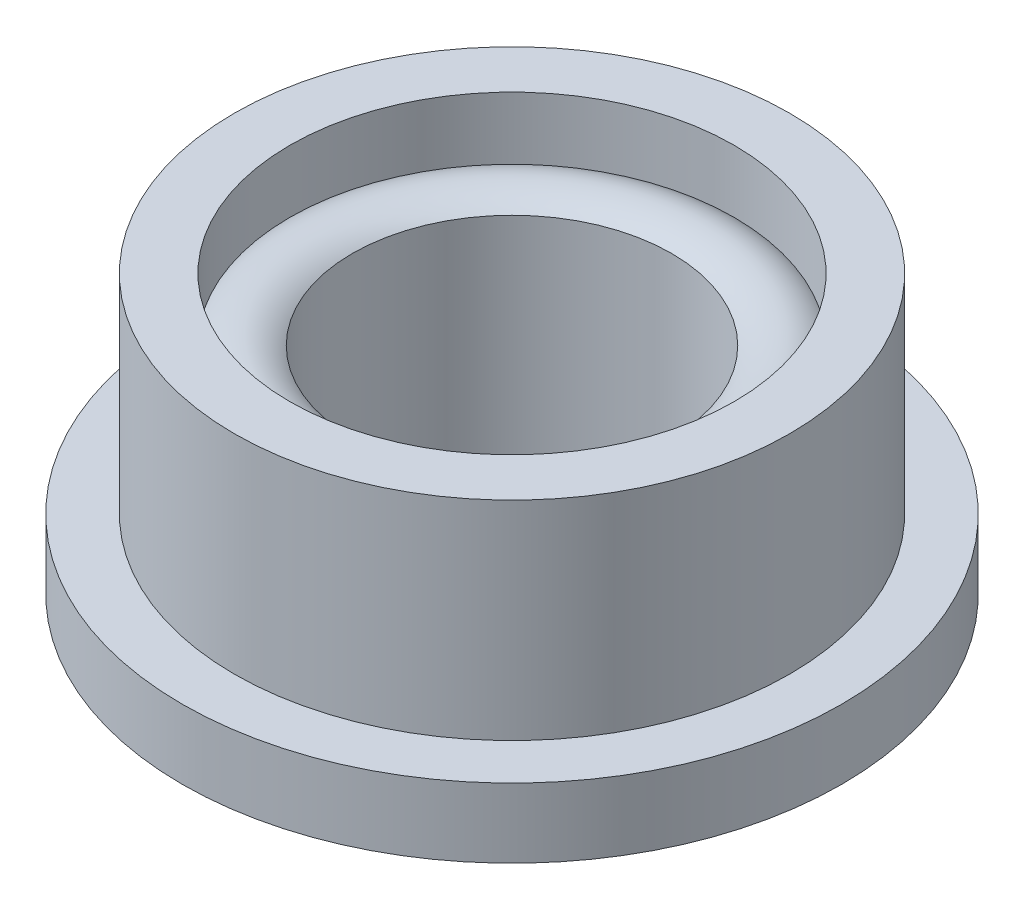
from build123d import *

# Parameters (mm, degrees)
SKETCH2_R           = 4.75
SKETCH2_R_2         = 1.5
BOSS_EXTRUDE1_DEPTH = 1
SKETCH3_R           = 4
SKETCH3_R_2         = 1.5
BOSS_EXTRUDE2_DEPTH = 3
SKETCH4_R           = 3.2
SKETCH4_R_2         = 2.3
CUT_EXTRUDE1_DEPTH  = 0.9
SKETCH6_R           = 2.3
SKETCH6_R_2         = 1.5
CUT_EXTRUDE3_DEPTH  = 10


with BuildPart() as part:
    # Sketch2 → Boss-Extrude1 (new body)
    with BuildSketch(Plane(origin=(0, 0, 0), x_dir=(1, 0, 0), z_dir=(0, 1, 0))):
        with Locations(Location((0, 0, 0), (0, 0, 270))):
            Circle(SKETCH2_R)
        with Locations(Location((0, 0, 0), (0, 0, 270))):
            Circle(SKETCH2_R_2, mode=Mode.SUBTRACT)
    extrude(amount=BOSS_EXTRUDE1_DEPTH)

    # Sketch3 → Boss-Extrude2 (add)
    with BuildSketch(Plane(origin=(0, 1, 0), x_dir=(1, 0, 0), z_dir=(0, 1, 0))):
        with Locations(Location((0, 0, 0), (0, 0, 270))):
            Circle(SKETCH3_R)
        with Locations(Location((0, 0, 0), (0, 0, 270))):
            Circle(SKETCH3_R_2, mode=Mode.SUBTRACT)
    extrude(amount=BOSS_EXTRUDE2_DEPTH)

    # Sketch4 → Cut-Extrude1 (cut)
    with BuildSketch(Plane(origin=(0, 4, 0), x_dir=(1, 0, 0), z_dir=(0, 1, 0))):
        with Locations(Location((0, 0, 0), (0, 0, 270))):
            Circle(SKETCH4_R)
        with Locations(Location((0, 0, 0), (0, 0, 270))):
            Circle(SKETCH4_R_2, mode=Mode.SUBTRACT)
    extrude(amount=-CUT_EXTRUDE1_DEPTH, mode=Mode.SUBTRACT)

    # Sketch5 → Revolve1 (revolve)
    with BuildSketch(Plane(origin=(0, 0, 0), x_dir=(0, 0, -1), z_dir=(1, 0, 0))):
        with BuildLine():
            Line((-3.2, 3.1), (-2.3, 3.1))
            ThreePointArc((-2.3, 3.1), (-2.75, 3.25), (-3.2, 3.1))
        make_face()
    revolve(axis=Axis((0, 4, 0), (0, -1, 0)))

    # Sketch6 → Cut-Extrude3 (cut)
    with BuildSketch(Plane(origin=(0, 4, 0), x_dir=(1, 0, 0), z_dir=(0, 1, 0))):
        with Locations(Location((0, 0, 0), (0, 0, 270))):
            Circle(SKETCH6_R)
        Circle(SKETCH6_R_2, mode=Mode.SUBTRACT)
    extrude(amount=-CUT_EXTRUDE3_DEPTH, mode=Mode.SUBTRACT)


solid = part.part
